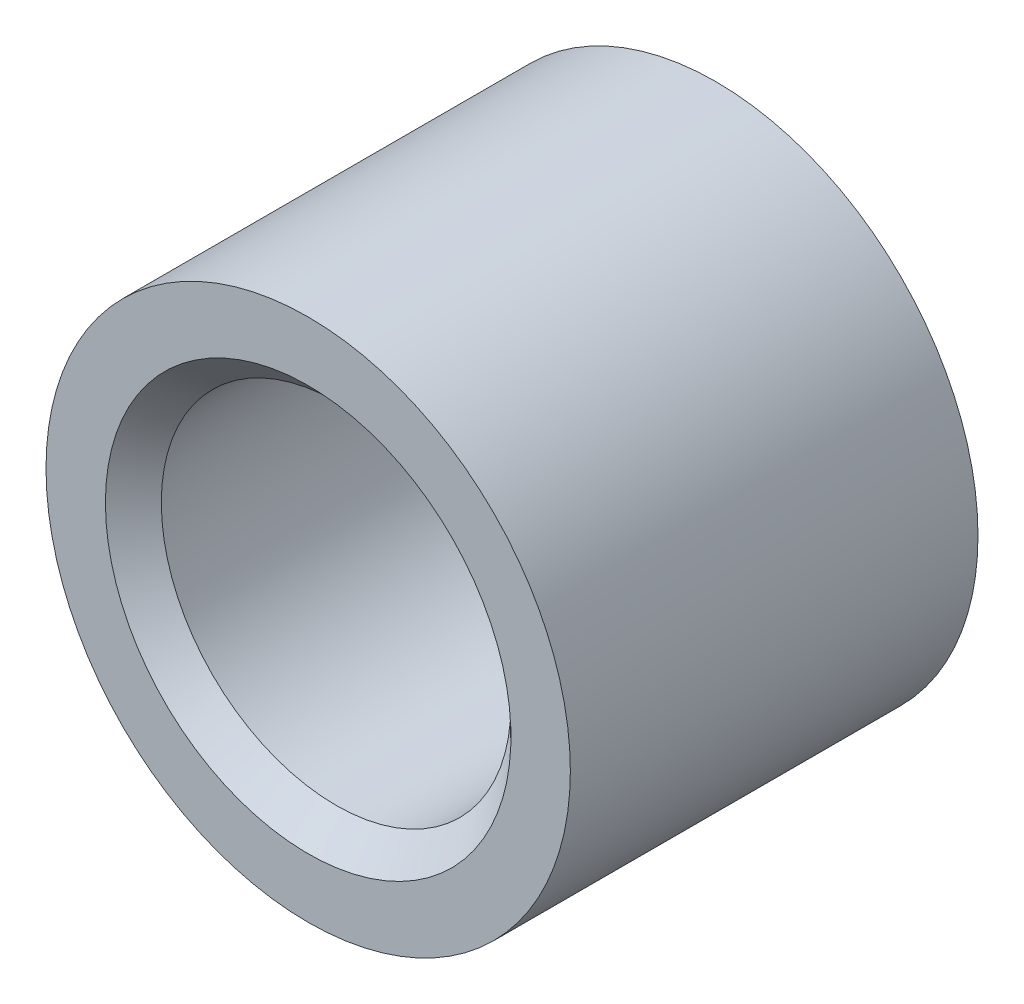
ISO-10303-21;
HEADER;
FILE_DESCRIPTION(('STEP AP214'),'2;1');
FILE_NAME('part.step','',(''),(''),'','','');
FILE_SCHEMA(('AUTOMOTIVE_DESIGN { 1 0 10303 214 1 1 1 1 }'));
ENDSEC;
DATA;
#1=APPLICATION_CONTEXT('core data for automotive mechanical design processes');
#2=APPLICATION_PROTOCOL_DEFINITION('international standard','automotive_design',2000,#1);
#3=PRODUCT_CONTEXT('',#1,'mechanical');
#4=PRODUCT('Part','Part','',(#3));
#5=PRODUCT_RELATED_PRODUCT_CATEGORY('part','',(#4));
#6=PRODUCT_DEFINITION_FORMATION('','',#4);
#7=PRODUCT_DEFINITION_CONTEXT('part definition',#1,'design');
#8=PRODUCT_DEFINITION('design','',#6,#7);
#9=PRODUCT_DEFINITION_SHAPE('','',#8);
#10=(LENGTH_UNIT() NAMED_UNIT(*) SI_UNIT(.MILLI.,.METRE.));
#11=(NAMED_UNIT(*) PLANE_ANGLE_UNIT() SI_UNIT($,.RADIAN.));
#12=(NAMED_UNIT(*) SI_UNIT($,.STERADIAN.) SOLID_ANGLE_UNIT());
#13=UNCERTAINTY_MEASURE_WITH_UNIT(LENGTH_MEASURE(1.E-05),#10,'distance_accuracy_value','');
#14=(GEOMETRIC_REPRESENTATION_CONTEXT(3) GLOBAL_UNCERTAINTY_ASSIGNED_CONTEXT((#13)) GLOBAL_UNIT_ASSIGNED_CONTEXT((#10,
#11,#12)) REPRESENTATION_CONTEXT('',''));
#15=CARTESIAN_POINT('',(0.,0.,0.));
#16=DIRECTION('',(0.,0.,1.));
#17=DIRECTION('',(1.,0.,0.));
#18=AXIS2_PLACEMENT_3D('',#15,#16,#17);
#19=CARTESIAN_POINT('',(0.,0.,31.775));
#20=DIRECTION('',(0.,0.,1.));
#21=DIRECTION('',(1.,0.,0.));
#22=AXIS2_PLACEMENT_3D('',#19,#20,#21);
#23=CYLINDRICAL_SURFACE('',#22,14.29385);
#24=CARTESIAN_POINT('',(0.,0.,0.));
#25=DIRECTION('',(0.,0.,1.));
#26=DIRECTION('',(1.,0.,0.));
#27=AXIS2_PLACEMENT_3D('',#24,#25,#26);
#28=CIRCLE('',#27,14.29385);
#29=CARTESIAN_POINT('',(14.29385,0.,0.));
#30=VERTEX_POINT('',#29);
#31=EDGE_CURVE('E32',#30,#30,#28,.T.);
#32=ORIENTED_EDGE('',*,*,#31,.F.);
#33=EDGE_LOOP('',(#32));
#34=FACE_BOUND('',#33,.T.);
#35=CARTESIAN_POINT('',(0.,0.,-22.225));
#36=DIRECTION('',(0.,0.,1.));
#37=DIRECTION('',(1.,0.,0.));
#38=AXIS2_PLACEMENT_3D('',#35,#36,#37);
#39=CIRCLE('',#38,14.29385);
#40=CARTESIAN_POINT('',(14.29385,0.,-22.225));
#41=VERTEX_POINT('',#40);
#42=EDGE_CURVE('E35',#41,#41,#39,.T.);
#43=ORIENTED_EDGE('',*,*,#42,.T.);
#44=EDGE_LOOP('',(#43));
#45=FACE_BOUND('',#44,.T.);
#46=ADVANCED_FACE('F13',(#34,#45),#23,.T.);
#47=CARTESIAN_POINT('',(14.29385,0.,0.));
#48=DIRECTION('',(0.,0.,-1.));
#49=DIRECTION('',(-1.,0.,0.));
#50=AXIS2_PLACEMENT_3D('',#47,#48,#49);
#51=PLANE('',#50);
#52=CARTESIAN_POINT('',(0.,0.,0.));
#53=DIRECTION('',(0.,0.,-1.));
#54=DIRECTION('',(-1.,0.,0.));
#55=AXIS2_PLACEMENT_3D('',#52,#53,#54);
#56=CIRCLE('',#55,11.05535);
#57=CARTESIAN_POINT('',(-11.05535,0.,0.));
#58=VERTEX_POINT('',#57);
#59=EDGE_CURVE('E9',#58,#58,#56,.T.);
#60=ORIENTED_EDGE('',*,*,#59,.T.);
#61=EDGE_LOOP('',(#60));
#62=FACE_BOUND('',#61,.T.);
#63=ORIENTED_EDGE('',*,*,#31,.T.);
#64=EDGE_LOOP('',(#63));
#65=FACE_BOUND('',#64,.T.);
#66=ADVANCED_FACE('F55',(#62,#65),#51,.F.);
#67=CARTESIAN_POINT('',(0.,0.,31.775));
#68=DIRECTION('',(0.,0.,1.));
#69=DIRECTION('',(1.,0.,0.));
#70=AXIS2_PLACEMENT_3D('',#67,#68,#69);
#71=CYLINDRICAL_SURFACE('',#70,9.53135);
#72=CARTESIAN_POINT('',(0.,0.,-20.701));
#73=DIRECTION('',(0.,0.,1.));
#74=DIRECTION('',(1.,0.,0.));
#75=AXIS2_PLACEMENT_3D('',#72,#73,#74);
#76=CIRCLE('',#75,9.53135);
#77=CARTESIAN_POINT('',(9.53135,0.,-20.701));
#78=VERTEX_POINT('',#77);
#79=EDGE_CURVE('E19',#78,#78,#76,.F.);
#80=ORIENTED_EDGE('',*,*,#79,.T.);
#81=EDGE_LOOP('',(#80));
#82=FACE_BOUND('',#81,.T.);
#83=CARTESIAN_POINT('',(0.,0.,-1.524));
#84=DIRECTION('',(0.,0.,-1.));
#85=DIRECTION('',(-1.,0.,0.));
#86=AXIS2_PLACEMENT_3D('',#83,#84,#85);
#87=CIRCLE('',#86,9.53135);
#88=CARTESIAN_POINT('',(-9.53135,0.,-1.524));
#89=VERTEX_POINT('',#88);
#90=EDGE_CURVE('E23',#89,#89,#87,.F.);
#91=ORIENTED_EDGE('',*,*,#90,.T.);
#92=EDGE_LOOP('',(#91));
#93=FACE_BOUND('',#92,.T.);
#94=ADVANCED_FACE('F43',(#82,#93),#71,.F.);
#95=CARTESIAN_POINT('',(9.53135,0.,-22.225));
#96=DIRECTION('',(0.,0.,1.));
#97=DIRECTION('',(1.,0.,0.));
#98=AXIS2_PLACEMENT_3D('',#95,#96,#97);
#99=PLANE('',#98);
#100=CARTESIAN_POINT('',(0.,0.,-22.225));
#101=DIRECTION('',(0.,0.,1.));
#102=DIRECTION('',(1.,0.,0.));
#103=AXIS2_PLACEMENT_3D('',#100,#101,#102);
#104=CIRCLE('',#103,11.05535);
#105=CARTESIAN_POINT('',(11.05535,0.,-22.225));
#106=VERTEX_POINT('',#105);
#107=EDGE_CURVE('E27',#106,#106,#104,.T.);
#108=ORIENTED_EDGE('',*,*,#107,.T.);
#109=EDGE_LOOP('',(#108));
#110=FACE_BOUND('',#109,.T.);
#111=ORIENTED_EDGE('',*,*,#42,.F.);
#112=EDGE_LOOP('',(#111));
#113=FACE_BOUND('',#112,.T.);
#114=ADVANCED_FACE('F40',(#110,#113),#99,.F.);
#115=CARTESIAN_POINT('',(0.,0.,-22.225));
#116=DIRECTION('',(0.,0.,-1.));
#117=DIRECTION('',(-1.,0.,0.));
#118=AXIS2_PLACEMENT_3D('',#115,#116,#117);
#119=CONICAL_SURFACE('',#118,11.05535,0.785398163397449);
#120=ORIENTED_EDGE('',*,*,#79,.F.);
#121=EDGE_LOOP('',(#120));
#122=FACE_BOUND('',#121,.T.);
#123=ORIENTED_EDGE('',*,*,#107,.F.);
#124=EDGE_LOOP('',(#123));
#125=FACE_BOUND('',#124,.T.);
#126=ADVANCED_FACE('F42',(#122,#125),#119,.F.);
#127=CARTESIAN_POINT('',(0.,0.,-1.524));
#128=DIRECTION('',(0.,0.,1.));
#129=DIRECTION('',(1.,0.,0.));
#130=AXIS2_PLACEMENT_3D('',#127,#128,#129);
#131=CONICAL_SURFACE('',#130,9.53135,0.785398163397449);
#132=ORIENTED_EDGE('',*,*,#59,.F.);
#133=EDGE_LOOP('',(#132));
#134=FACE_BOUND('',#133,.T.);
#135=ORIENTED_EDGE('',*,*,#90,.F.);
#136=EDGE_LOOP('',(#135));
#137=FACE_BOUND('',#136,.T.);
#138=ADVANCED_FACE('F52',(#134,#137),#131,.F.);
#139=CLOSED_SHELL('',(#46,#66,#94,#114,#126,#138));
#140=MANIFOLD_SOLID_BREP('B1',#139);
#141=ADVANCED_BREP_SHAPE_REPRESENTATION('',(#18,#140),#14);
#142=SHAPE_DEFINITION_REPRESENTATION(#9,#141);
ENDSEC;
END-ISO-10303-21;
